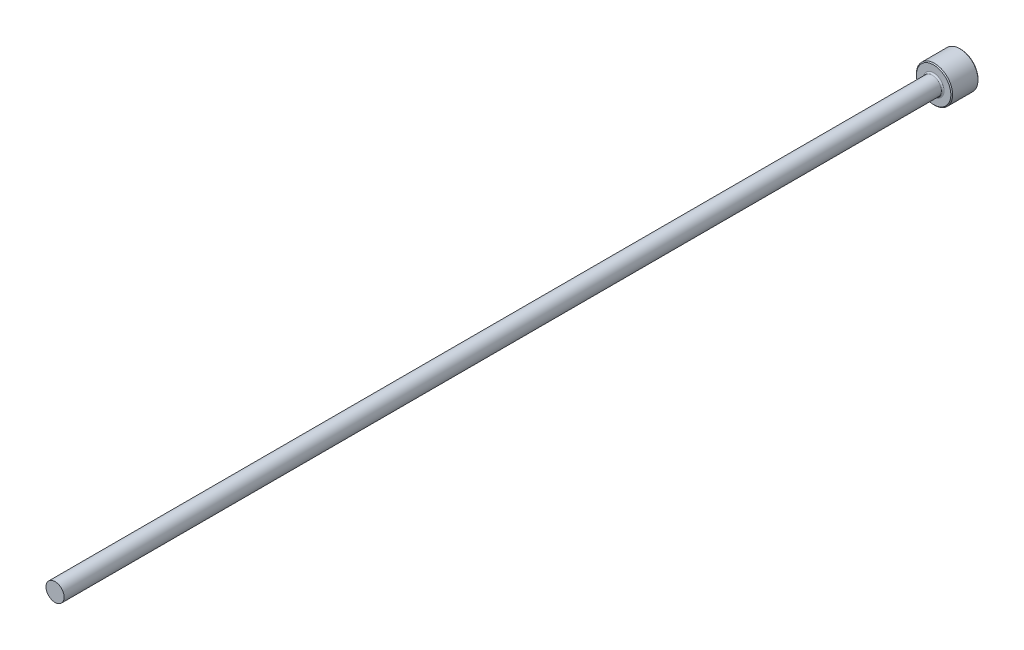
ISO-10303-21;
HEADER;
FILE_DESCRIPTION(('STEP AP214'),'2;1');
FILE_NAME('part.step','',(''),(''),'','','');
FILE_SCHEMA(('AUTOMOTIVE_DESIGN { 1 0 10303 214 1 1 1 1 }'));
ENDSEC;
DATA;
#1=APPLICATION_CONTEXT('core data for automotive mechanical design processes');
#2=APPLICATION_PROTOCOL_DEFINITION('international standard','automotive_design',2000,#1);
#3=PRODUCT_CONTEXT('',#1,'mechanical');
#4=PRODUCT('Part','Part','',(#3));
#5=PRODUCT_RELATED_PRODUCT_CATEGORY('part','',(#4));
#6=PRODUCT_DEFINITION_FORMATION('','',#4);
#7=PRODUCT_DEFINITION_CONTEXT('part definition',#1,'design');
#8=PRODUCT_DEFINITION('design','',#6,#7);
#9=PRODUCT_DEFINITION_SHAPE('','',#8);
#10=(LENGTH_UNIT() NAMED_UNIT(*) SI_UNIT(.MILLI.,.METRE.));
#11=(NAMED_UNIT(*) PLANE_ANGLE_UNIT() SI_UNIT($,.RADIAN.));
#12=(NAMED_UNIT(*) SI_UNIT($,.STERADIAN.) SOLID_ANGLE_UNIT());
#13=UNCERTAINTY_MEASURE_WITH_UNIT(LENGTH_MEASURE(1.E-05),#10,'distance_accuracy_value','');
#14=(GEOMETRIC_REPRESENTATION_CONTEXT(3) GLOBAL_UNCERTAINTY_ASSIGNED_CONTEXT((#13)) GLOBAL_UNIT_ASSIGNED_CONTEXT((#10,
#11,#12)) REPRESENTATION_CONTEXT('',''));
#15=CARTESIAN_POINT('',(0.,0.,0.));
#16=DIRECTION('',(0.,0.,1.));
#17=DIRECTION('',(1.,0.,0.));
#18=AXIS2_PLACEMENT_3D('',#15,#16,#17);
#19=CARTESIAN_POINT('',(0.,1.99999999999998,200.));
#20=DIRECTION('',(0.,0.,-1.));
#21=DIRECTION('',(-1.,0.,0.));
#22=AXIS2_PLACEMENT_3D('',#19,#20,#21);
#23=PLANE('',#22);
#24=CARTESIAN_POINT('',(0.,0.,200.));
#25=DIRECTION('',(0.,0.,1.));
#26=DIRECTION('',(1.,0.,0.));
#27=AXIS2_PLACEMENT_3D('',#24,#25,#26);
#28=CIRCLE('',#27,1.99999999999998);
#29=CARTESIAN_POINT('',(1.99999999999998,0.,200.));
#30=VERTEX_POINT('',#29);
#31=EDGE_CURVE('E50',#30,#30,#28,.T.);
#32=ORIENTED_EDGE('',*,*,#31,.T.);
#33=EDGE_LOOP('',(#32));
#34=FACE_BOUND('',#33,.T.);
#35=ADVANCED_FACE('F30',(#34),#23,.F.);
#36=CARTESIAN_POINT('',(0.,0.,109.050628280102));
#37=DIRECTION('',(0.,0.,1.));
#38=DIRECTION('',(1.,0.,0.));
#39=AXIS2_PLACEMENT_3D('',#36,#37,#38);
#40=CYLINDRICAL_SURFACE('',#39,1.99999999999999);
#41=ORIENTED_EDGE('',*,*,#31,.F.);
#42=EDGE_LOOP('',(#41));
#43=FACE_BOUND('',#42,.T.);
#44=CARTESIAN_POINT('',(0.,0.,6.3));
#45=DIRECTION('',(0.,0.,1.));
#46=DIRECTION('',(1.,0.,0.));
#47=AXIS2_PLACEMENT_3D('',#44,#45,#46);
#48=CIRCLE('',#47,2.);
#49=CARTESIAN_POINT('',(2.,0.,6.3));
#50=VERTEX_POINT('',#49);
#51=EDGE_CURVE('E53',#50,#50,#48,.T.);
#52=ORIENTED_EDGE('',*,*,#51,.T.);
#53=EDGE_LOOP('',(#52));
#54=FACE_BOUND('',#53,.T.);
#55=ADVANCED_FACE('F73',(#43,#54),#40,.T.);
#56=CARTESIAN_POINT('',(0.,0.,6.3));
#57=DIRECTION('',(0.,0.,1.));
#58=DIRECTION('',(1.,0.,0.));
#59=AXIS2_PLACEMENT_3D('',#56,#57,#58);
#60=TOROIDAL_SURFACE('',#59,2.3,0.3);
#61=ORIENTED_EDGE('',*,*,#51,.F.);
#62=EDGE_LOOP('',(#61));
#63=FACE_BOUND('',#62,.T.);
#64=CARTESIAN_POINT('',(0.,0.,6.00000000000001));
#65=DIRECTION('',(0.,0.,1.));
#66=DIRECTION('',(1.,0.,0.));
#67=AXIS2_PLACEMENT_3D('',#64,#65,#66);
#68=CIRCLE('',#67,2.3);
#69=CARTESIAN_POINT('',(2.3,0.,6.00000000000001));
#70=VERTEX_POINT('',#69);
#71=EDGE_CURVE('E56',#70,#70,#68,.T.);
#72=ORIENTED_EDGE('',*,*,#71,.T.);
#73=EDGE_LOOP('',(#72));
#74=FACE_BOUND('',#73,.T.);
#75=ADVANCED_FACE('F60',(#63,#74),#60,.F.);
#76=CARTESIAN_POINT('',(0.,4.,6.));
#77=DIRECTION('',(0.,0.,-1.));
#78=DIRECTION('',(-1.,0.,0.));
#79=AXIS2_PLACEMENT_3D('',#76,#77,#78);
#80=PLANE('',#79);
#81=CARTESIAN_POINT('',(0.,0.,6.));
#82=DIRECTION('',(0.,0.,-1.));
#83=DIRECTION('',(-1.,0.,0.));
#84=AXIS2_PLACEMENT_3D('',#81,#82,#83);
#85=CIRCLE('',#84,3.80000000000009);
#86=CARTESIAN_POINT('',(-3.80000000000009,0.,6.));
#87=VERTEX_POINT('',#86);
#88=EDGE_CURVE('E10',#87,#87,#85,.F.);
#89=ORIENTED_EDGE('',*,*,#88,.T.);
#90=EDGE_LOOP('',(#89));
#91=FACE_BOUND('',#90,.T.);
#92=ORIENTED_EDGE('',*,*,#71,.F.);
#93=EDGE_LOOP('',(#92));
#94=FACE_BOUND('',#93,.T.);
#95=ADVANCED_FACE('F62',(#91,#94),#80,.F.);
#96=CARTESIAN_POINT('',(0.,0.,109.050628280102));
#97=DIRECTION('',(0.,0.,1.));
#98=DIRECTION('',(1.,0.,0.));
#99=AXIS2_PLACEMENT_3D('',#96,#97,#98);
#100=CYLINDRICAL_SURFACE('',#99,4.);
#101=CARTESIAN_POINT('',(0.,0.,0.199999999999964));
#102=DIRECTION('',(0.,0.,1.));
#103=DIRECTION('',(1.,0.,0.));
#104=AXIS2_PLACEMENT_3D('',#101,#102,#103);
#105=CIRCLE('',#104,4.);
#106=CARTESIAN_POINT('',(4.,0.,0.199999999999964));
#107=VERTEX_POINT('',#106);
#108=EDGE_CURVE('E41',#107,#107,#105,.T.);
#109=ORIENTED_EDGE('',*,*,#108,.T.);
#110=EDGE_LOOP('',(#109));
#111=FACE_BOUND('',#110,.T.);
#112=CARTESIAN_POINT('',(0.,0.,5.80000000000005));
#113=DIRECTION('',(0.,0.,-1.));
#114=DIRECTION('',(-1.,0.,0.));
#115=AXIS2_PLACEMENT_3D('',#112,#113,#114);
#116=CIRCLE('',#115,4.);
#117=CARTESIAN_POINT('',(-4.,0.,5.80000000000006));
#118=VERTEX_POINT('',#117);
#119=EDGE_CURVE('E45',#118,#118,#116,.T.);
#120=ORIENTED_EDGE('',*,*,#119,.T.);
#121=EDGE_LOOP('',(#120));
#122=FACE_BOUND('',#121,.T.);
#123=ADVANCED_FACE('F64',(#111,#122),#100,.T.);
#124=CARTESIAN_POINT('',(0.,0.,0.));
#125=DIRECTION('',(0.,0.,1.));
#126=DIRECTION('',(1.,0.,0.));
#127=AXIS2_PLACEMENT_3D('',#124,#125,#126);
#128=PLANE('',#127);
#129=CARTESIAN_POINT('',(0.,0.,0.));
#130=DIRECTION('',(0.,0.,1.));
#131=DIRECTION('',(1.,0.,0.));
#132=AXIS2_PLACEMENT_3D('',#129,#130,#131);
#133=CIRCLE('',#132,3.8);
#134=CARTESIAN_POINT('',(3.8,0.,0.));
#135=VERTEX_POINT('',#134);
#136=EDGE_CURVE('E37',#135,#135,#133,.F.);
#137=ORIENTED_EDGE('',*,*,#136,.T.);
#138=EDGE_LOOP('',(#137));
#139=FACE_BOUND('',#138,.T.);
#140=ADVANCED_FACE('F70',(#139),#128,.F.);
#141=CARTESIAN_POINT('',(0.,0.,0.199999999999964));
#142=DIRECTION('',(0.,0.,1.));
#143=DIRECTION('',(1.,0.,0.));
#144=AXIS2_PLACEMENT_3D('',#141,#142,#143);
#145=CONICAL_SURFACE('',#144,4.,0.785398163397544);
#146=ORIENTED_EDGE('',*,*,#136,.F.);
#147=EDGE_LOOP('',(#146));
#148=FACE_BOUND('',#147,.T.);
#149=ORIENTED_EDGE('',*,*,#108,.F.);
#150=EDGE_LOOP('',(#149));
#151=FACE_BOUND('',#150,.T.);
#152=ADVANCED_FACE('F84',(#148,#151),#145,.T.);
#153=CARTESIAN_POINT('',(0.,0.,6.00000000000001));
#154=DIRECTION('',(0.,0.,-1.));
#155=DIRECTION('',(-1.,0.,0.));
#156=AXIS2_PLACEMENT_3D('',#153,#154,#155);
#157=CONICAL_SURFACE('',#156,3.80000000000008,0.78539816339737);
#158=CARTESIAN_POINT('',(-4.,0.,5.80000000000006));
#159=CARTESIAN_POINT('',(-3.99791666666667,0.,5.80208333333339));
#160=CARTESIAN_POINT('',(-3.99583333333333,0.,5.80416666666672));
#161=CARTESIAN_POINT('',(-3.99166666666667,0.,5.80833333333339));
#162=CARTESIAN_POINT('',(-3.98958333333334,0.,5.81041666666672));
#163=CARTESIAN_POINT('',(-3.98541666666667,0.,5.81458333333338));
#164=CARTESIAN_POINT('',(-3.98333333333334,0.,5.81666666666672));
#165=CARTESIAN_POINT('',(-3.97916666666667,0.,5.82083333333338));
#166=CARTESIAN_POINT('',(-3.97708333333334,0.,5.82291666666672));
#167=CARTESIAN_POINT('',(-3.97291666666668,0.,5.82708333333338));
#168=CARTESIAN_POINT('',(-3.97083333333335,0.,5.82916666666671));
#169=CARTESIAN_POINT('',(-3.96666666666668,0.,5.83333333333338));
#170=CARTESIAN_POINT('',(-3.96458333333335,0.,5.83541666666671));
#171=CARTESIAN_POINT('',(-3.96041666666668,0.,5.83958333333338));
#172=CARTESIAN_POINT('',(-3.95833333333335,0.,5.84166666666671));
#173=CARTESIAN_POINT('',(-3.95416666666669,0.,5.84583333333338));
#174=CARTESIAN_POINT('',(-3.95208333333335,0.,5.84791666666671));
#175=CARTESIAN_POINT('',(-3.94791666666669,0.,5.85208333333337));
#176=CARTESIAN_POINT('',(-3.94583333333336,0.,5.85416666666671));
#177=CARTESIAN_POINT('',(-3.94166666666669,0.,5.85833333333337));
#178=CARTESIAN_POINT('',(-3.93958333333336,0.,5.86041666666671));
#179=CARTESIAN_POINT('',(-3.93541666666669,0.,5.86458333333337));
#180=CARTESIAN_POINT('',(-3.93333333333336,0.,5.8666666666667));
#181=CARTESIAN_POINT('',(-3.9291666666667,0.,5.87083333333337));
#182=CARTESIAN_POINT('',(-3.92708333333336,0.,5.8729166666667));
#183=CARTESIAN_POINT('',(-3.9229166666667,0.,5.87708333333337));
#184=CARTESIAN_POINT('',(-3.92083333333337,0.,5.8791666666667));
#185=CARTESIAN_POINT('',(-3.9166666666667,0.,5.88333333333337));
#186=CARTESIAN_POINT('',(-3.91458333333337,0.,5.8854166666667));
#187=CARTESIAN_POINT('',(-3.91041666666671,0.,5.88958333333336));
#188=CARTESIAN_POINT('',(-3.90833333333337,0.,5.8916666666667));
#189=CARTESIAN_POINT('',(-3.90416666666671,0.,5.89583333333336));
#190=CARTESIAN_POINT('',(-3.90208333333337,0.,5.8979166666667));
#191=CARTESIAN_POINT('',(-3.89791666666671,0.,5.90208333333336));
#192=CARTESIAN_POINT('',(-3.89583333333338,0.,5.90416666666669));
#193=CARTESIAN_POINT('',(-3.89166666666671,0.,5.90833333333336));
#194=CARTESIAN_POINT('',(-3.88958333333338,0.,5.91041666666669));
#195=CARTESIAN_POINT('',(-3.88541666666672,0.,5.91458333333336));
#196=CARTESIAN_POINT('',(-3.88333333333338,0.,5.91666666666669));
#197=CARTESIAN_POINT('',(-3.87916666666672,0.,5.92083333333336));
#198=CARTESIAN_POINT('',(-3.87708333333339,0.,5.92291666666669));
#199=CARTESIAN_POINT('',(-3.87291666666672,0.,5.92708333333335));
#200=CARTESIAN_POINT('',(-3.87083333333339,0.,5.92916666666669));
#201=CARTESIAN_POINT('',(-3.86666666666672,0.,5.93333333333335));
#202=CARTESIAN_POINT('',(-3.86458333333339,0.,5.93541666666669));
#203=CARTESIAN_POINT('',(-3.86041666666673,0.,5.93958333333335));
#204=CARTESIAN_POINT('',(-3.85833333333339,0.,5.94166666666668));
#205=CARTESIAN_POINT('',(-3.85416666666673,0.,5.94583333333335));
#206=CARTESIAN_POINT('',(-3.8520833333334,0.,5.94791666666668));
#207=CARTESIAN_POINT('',(-3.84791666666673,0.,5.95208333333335));
#208=CARTESIAN_POINT('',(-3.8458333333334,0.,5.95416666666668));
#209=CARTESIAN_POINT('',(-3.84166666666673,0.,5.95833333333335));
#210=CARTESIAN_POINT('',(-3.8395833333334,0.,5.96041666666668));
#211=CARTESIAN_POINT('',(-3.83541666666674,0.,5.96458333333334));
#212=CARTESIAN_POINT('',(-3.8333333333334,0.,5.96666666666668));
#213=CARTESIAN_POINT('',(-3.82916666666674,0.,5.97083333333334));
#214=CARTESIAN_POINT('',(-3.82708333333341,0.,5.97291666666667));
#215=CARTESIAN_POINT('',(-3.82291666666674,0.,5.97708333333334));
#216=CARTESIAN_POINT('',(-3.82083333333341,0.,5.97916666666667));
#217=CARTESIAN_POINT('',(-3.81666666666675,0.,5.98333333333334));
#218=CARTESIAN_POINT('',(-3.81458333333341,0.,5.98541666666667));
#219=CARTESIAN_POINT('',(-3.81041666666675,0.,5.98958333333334));
#220=CARTESIAN_POINT('',(-3.80833333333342,0.,5.99166666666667));
#221=CARTESIAN_POINT('',(-3.80416666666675,0.,5.99583333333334));
#222=CARTESIAN_POINT('',(-3.80208333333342,0.,5.99791666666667));
#223=CARTESIAN_POINT('',(-3.80000000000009,0.,6.));
#224=B_SPLINE_CURVE_WITH_KNOTS('',3,(#158,#159,#160,#161,#162,#163,#164,#165,#166,#167,#168,
#169,#170,#171,#172,#173,#174,#175,#176,#177,#178,#179,#180,#181,#182,#183,#184,#185,#186,#187,
#188,#189,#190,#191,#192,#193,#194,#195,#196,#197,#198,#199,#200,#201,#202,#203,#204,#205,#206,
#207,#208,#209,#210,#211,#212,#213,#214,#215,#216,#217,#218,#219,#220,#221,#222,#223),
.UNSPECIFIED.,.F.,.F.,(4,2,2,2,2,2,2,2,2,2,2,2,2,2,2,2,2,2,2,2,2,2,2,2,2,2,2,2,2,2,2,2,4),(0.,
0.0088388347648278,0.0176776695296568,0.0265165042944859,0.0353553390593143,0.0441941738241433,
0.0530330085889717,0.0618718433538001,0.0707106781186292,0.0795495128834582,0.0883883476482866,
0.0972271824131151,0.106066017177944,0.114904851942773,0.123743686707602,0.132582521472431,
0.141421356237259,0.150260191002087,0.159099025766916,0.167937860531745,0.176776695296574,
0.185615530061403,0.194454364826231,0.20329319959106,0.212132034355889,0.220970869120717,
0.229809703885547,0.238648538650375,0.247487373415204,0.256326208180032,0.265165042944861,
0.27400387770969,0.282842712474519),.UNSPECIFIED.);
#225=EDGE_CURVE('BSEAM32',#118,#87,#224,.T.);
#226=ORIENTED_EDGE('',*,*,#119,.F.);
#227=ORIENTED_EDGE('',*,*,#88,.F.);
#228=ORIENTED_EDGE('',*,*,#225,.T.);
#229=ORIENTED_EDGE('',*,*,#225,.F.);
#230=EDGE_LOOP('',(#226,#228,#227,#229));
#231=FACE_BOUND('',#230,.T.);
#232=ADVANCED_FACE('F32',(#231),#157,.T.);
#233=CLOSED_SHELL('',(#35,#55,#75,#95,#123,#140,#152,#232));
#234=MANIFOLD_SOLID_BREP('B2',#233);
#235=ADVANCED_BREP_SHAPE_REPRESENTATION('',(#18,#234),#14);
#236=SHAPE_DEFINITION_REPRESENTATION(#9,#235);
ENDSEC;
END-ISO-10303-21;
